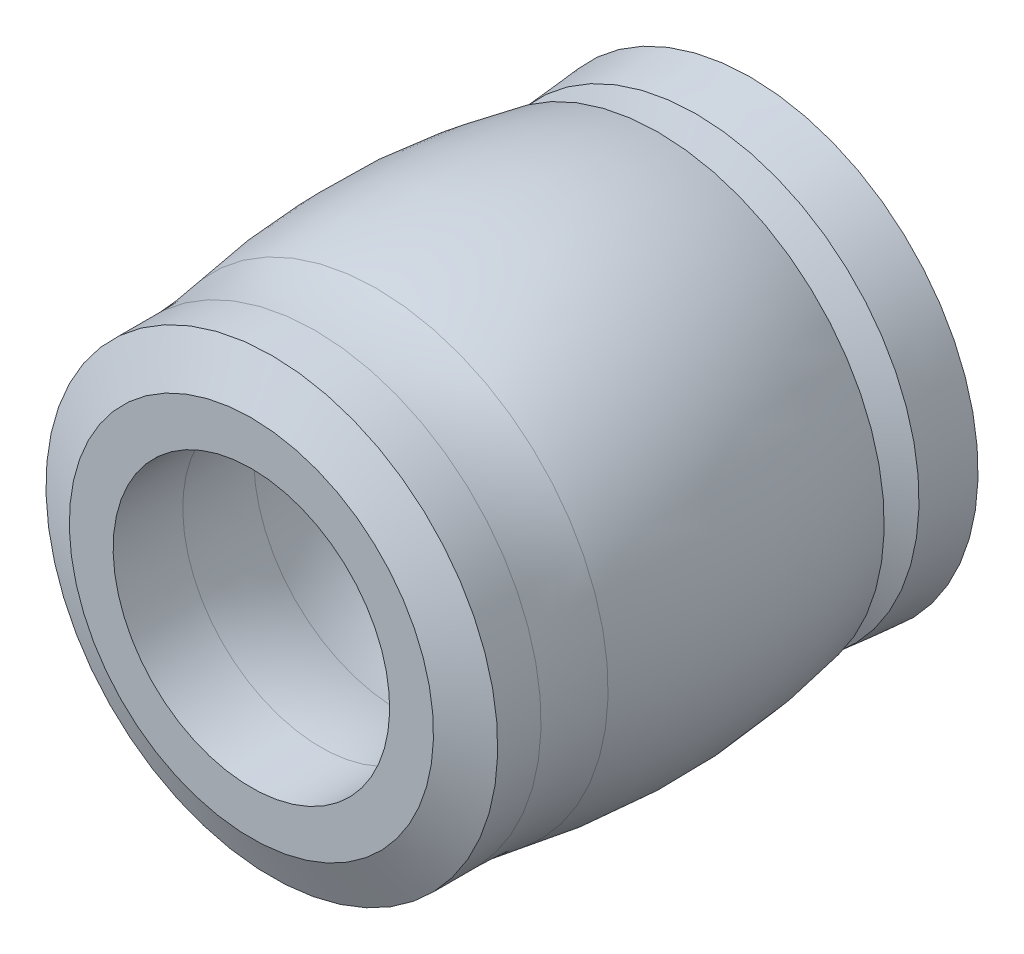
ISO-10303-21;
HEADER;
FILE_DESCRIPTION(('STEP AP214'),'2;1');
FILE_NAME('part.step','',(''),(''),'','','');
FILE_SCHEMA(('AUTOMOTIVE_DESIGN { 1 0 10303 214 1 1 1 1 }'));
ENDSEC;
DATA;
#1=APPLICATION_CONTEXT('core data for automotive mechanical design processes');
#2=APPLICATION_PROTOCOL_DEFINITION('international standard','automotive_design',2000,#1);
#3=PRODUCT_CONTEXT('',#1,'mechanical');
#4=PRODUCT('Part','Part','',(#3));
#5=PRODUCT_RELATED_PRODUCT_CATEGORY('part','',(#4));
#6=PRODUCT_DEFINITION_FORMATION('','',#4);
#7=PRODUCT_DEFINITION_CONTEXT('part definition',#1,'design');
#8=PRODUCT_DEFINITION('design','',#6,#7);
#9=PRODUCT_DEFINITION_SHAPE('','',#8);
#10=(LENGTH_UNIT() NAMED_UNIT(*) SI_UNIT(.MILLI.,.METRE.));
#11=(NAMED_UNIT(*) PLANE_ANGLE_UNIT() SI_UNIT($,.RADIAN.));
#12=(NAMED_UNIT(*) SI_UNIT($,.STERADIAN.) SOLID_ANGLE_UNIT());
#13=UNCERTAINTY_MEASURE_WITH_UNIT(LENGTH_MEASURE(1.E-05),#10,'distance_accuracy_value','');
#14=(GEOMETRIC_REPRESENTATION_CONTEXT(3) GLOBAL_UNCERTAINTY_ASSIGNED_CONTEXT((#13)) GLOBAL_UNIT_ASSIGNED_CONTEXT((#10,
#11,#12)) REPRESENTATION_CONTEXT('',''));
#15=CARTESIAN_POINT('',(0.,0.,0.));
#16=DIRECTION('',(0.,0.,1.));
#17=DIRECTION('',(1.,0.,0.));
#18=AXIS2_PLACEMENT_3D('',#15,#16,#17);
#19=CARTESIAN_POINT('',(0.,0.,7.81719223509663));
#20=DIRECTION('',(0.,0.,-1.));
#21=DIRECTION('',(0.,1.,0.));
#22=AXIS2_PLACEMENT_3D('',#19,#20,#21);
#23=TOROIDAL_SURFACE('',#22,12.954,2.54);
#24=CARTESIAN_POINT('',(0.,0.,7.81719223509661));
#25=DIRECTION('',(0.,0.,-1.));
#26=DIRECTION('',(0.,1.,0.));
#27=AXIS2_PLACEMENT_3D('',#24,#25,#26);
#28=CIRCLE('',#27,10.414);
#29=CARTESIAN_POINT('',(0.,10.414,7.81719223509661));
#30=VERTEX_POINT('',#29);
#31=EDGE_CURVE('E97',#30,#30,#28,.T.);
#32=ORIENTED_EDGE('',*,*,#31,.T.);
#33=EDGE_LOOP('',(#32));
#34=FACE_BOUND('',#33,.T.);
#35=CARTESIAN_POINT('',(0.,0.,8.42101933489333));
#36=DIRECTION('',(0.,0.,-1.));
#37=DIRECTION('',(0.,1.,0.));
#38=AXIS2_PLACEMENT_3D('',#35,#36,#37);
#39=CIRCLE('',#38,10.4868168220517);
#40=CARTESIAN_POINT('',(0.,10.4868168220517,8.42101933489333));
#41=VERTEX_POINT('',#40);
#42=EDGE_CURVE('E153',#41,#41,#39,.F.);
#43=ORIENTED_EDGE('',*,*,#42,.T.);
#44=EDGE_LOOP('',(#43));
#45=FACE_BOUND('',#44,.T.);
#46=ADVANCED_FACE('F12',(#34,#45),#23,.T.);
#47=CARTESIAN_POINT('',(0.,-30.8665991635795,18.542));
#48=DIRECTION('',(1.,0.,0.));
#49=DIRECTION('',(0.,1.,0.));
#50=AXIS2_PLACEMENT_3D('',#47,#48,#49);
#51=CIRCLE('',#50,42.57392703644);
#52=TRIMMED_CURVE('',#51,(PARAMETER_VALUE(-0.7597448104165)),(PARAMETER_VALUE(0.7597448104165)),
.T.,.PARAMETER.);
#53=CARTESIAN_POINT('',(0.,0.,18.542));
#54=DIRECTION('',(0.,0.,-1.));
#55=AXIS1_PLACEMENT('',#53,#54);
#56=SURFACE_OF_REVOLUTION('',#52,#55);
#57=ORIENTED_EDGE('',*,*,#42,.F.);
#58=EDGE_LOOP('',(#57));
#59=FACE_BOUND('',#58,.T.);
#60=CARTESIAN_POINT('',(0.,0.,26.449717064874));
#61=DIRECTION('',(0.,0.,-1.));
#62=DIRECTION('',(0.,1.,0.));
#63=AXIS2_PLACEMENT_3D('',#60,#61,#62);
#64=CIRCLE('',#63,10.9664891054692);
#65=CARTESIAN_POINT('',(0.,10.9664891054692,26.449717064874));
#66=VERTEX_POINT('',#65);
#67=EDGE_CURVE('E94',#66,#66,#64,.T.);
#68=ORIENTED_EDGE('',*,*,#67,.F.);
#69=EDGE_LOOP('',(#68));
#70=FACE_BOUND('',#69,.T.);
#71=ADVANCED_FACE('F101',(#59,#70),#56,.T.);
#72=CARTESIAN_POINT('',(0.,0.,-10.8003938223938));
#73=DIRECTION('',(0.,0.,-1.));
#74=DIRECTION('',(0.,1.,0.));
#75=AXIS2_PLACEMENT_3D('',#72,#73,#74);
#76=CYLINDRICAL_SURFACE('',#75,10.414);
#77=CARTESIAN_POINT('',(0.,0.,7.59227470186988));
#78=DIRECTION('',(0.,0.,1.));
#79=DIRECTION('',(0.,-1.,0.));
#80=AXIS2_PLACEMENT_3D('',#77,#78,#79);
#81=CIRCLE('',#80,10.414);
#82=CARTESIAN_POINT('',(0.,-10.414,7.59227470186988));
#83=VERTEX_POINT('',#82);
#84=EDGE_CURVE('E91',#83,#83,#81,.F.);
#85=ORIENTED_EDGE('',*,*,#84,.T.);
#86=EDGE_LOOP('',(#85));
#87=FACE_BOUND('',#86,.T.);
#88=ORIENTED_EDGE('',*,*,#31,.F.);
#89=EDGE_LOOP('',(#88));
#90=FACE_BOUND('',#89,.T.);
#91=ADVANCED_FACE('F84',(#87,#90),#76,.F.);
#92=CARTESIAN_POINT('',(0.,0.,32.3469888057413));
#93=DIRECTION('',(0.,0.,-1.));
#94=DIRECTION('',(0.,1.,0.));
#95=AXIS2_PLACEMENT_3D('',#92,#93,#94);
#96=TOROIDAL_SURFACE('',#95,42.164,31.75);
#97=ORIENTED_EDGE('',*,*,#67,.T.);
#98=EDGE_LOOP('',(#97));
#99=FACE_BOUND('',#98,.T.);
#100=CARTESIAN_POINT('',(0.,0.,32.3469888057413));
#101=DIRECTION('',(0.,0.,-1.));
#102=DIRECTION('',(0.,1.,0.));
#103=AXIS2_PLACEMENT_3D('',#100,#101,#102);
#104=CIRCLE('',#103,10.414);
#105=CARTESIAN_POINT('',(0.,10.414,32.3469888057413));
#106=VERTEX_POINT('',#105);
#107=EDGE_CURVE('E89',#106,#106,#104,.F.);
#108=ORIENTED_EDGE('',*,*,#107,.T.);
#109=EDGE_LOOP('',(#108));
#110=FACE_BOUND('',#109,.T.);
#111=ADVANCED_FACE('F79',(#99,#110),#96,.T.);
#112=CARTESIAN_POINT('',(0.,0.,7.59227470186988));
#113=DIRECTION('',(0.,0.,1.));
#114=DIRECTION('',(0.,-1.,0.));
#115=AXIS2_PLACEMENT_3D('',#112,#113,#114);
#116=CONICAL_SURFACE('',#115,10.414,1.13446401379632);
#117=ORIENTED_EDGE('',*,*,#84,.F.);
#118=EDGE_LOOP('',(#117));
#119=FACE_BOUND('',#118,.T.);
#120=CARTESIAN_POINT('',(0.,0.,4.572));
#121=DIRECTION('',(0.,0.,-1.));
#122=DIRECTION('',(0.,1.,0.));
#123=AXIS2_PLACEMENT_3D('',#120,#121,#122);
#124=CIRCLE('',#123,3.937);
#125=CARTESIAN_POINT('',(0.,3.937,4.572));
#126=VERTEX_POINT('',#125);
#127=EDGE_CURVE('E133',#126,#126,#124,.T.);
#128=ORIENTED_EDGE('',*,*,#127,.T.);
#129=EDGE_LOOP('',(#128));
#130=FACE_BOUND('',#129,.T.);
#131=ADVANCED_FACE('F75',(#119,#130),#116,.F.);
#132=CARTESIAN_POINT('',(0.,0.,-10.8003938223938));
#133=DIRECTION('',(0.,0.,-1.));
#134=DIRECTION('',(0.,1.,0.));
#135=AXIS2_PLACEMENT_3D('',#132,#133,#134);
#136=CYLINDRICAL_SURFACE('',#135,10.414);
#137=ORIENTED_EDGE('',*,*,#107,.F.);
#138=EDGE_LOOP('',(#137));
#139=FACE_BOUND('',#138,.T.);
#140=CARTESIAN_POINT('',(0.,0.,37.592));
#141=DIRECTION('',(0.,0.,-1.));
#142=DIRECTION('',(0.,1.,0.));
#143=AXIS2_PLACEMENT_3D('',#140,#141,#142);
#144=CIRCLE('',#143,10.414);
#145=CARTESIAN_POINT('',(0.,10.414,37.592));
#146=VERTEX_POINT('',#145);
#147=EDGE_CURVE('E16',#146,#146,#144,.T.);
#148=ORIENTED_EDGE('',*,*,#147,.F.);
#149=EDGE_LOOP('',(#148));
#150=FACE_BOUND('',#149,.T.);
#151=ADVANCED_FACE('F71',(#139,#150),#136,.F.);
#152=CARTESIAN_POINT('',(0.,0.,-10.8003938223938));
#153=DIRECTION('',(0.,0.,-1.));
#154=DIRECTION('',(0.,1.,0.));
#155=AXIS2_PLACEMENT_3D('',#152,#153,#154);
#156=CYLINDRICAL_SURFACE('',#155,3.937);
#157=CARTESIAN_POINT('',(0.,0.,0.));
#158=DIRECTION('',(0.,0.,-1.));
#159=DIRECTION('',(0.,1.,0.));
#160=AXIS2_PLACEMENT_3D('',#157,#158,#159);
#161=CIRCLE('',#160,3.937);
#162=CARTESIAN_POINT('',(0.,3.937,0.));
#163=VERTEX_POINT('',#162);
#164=EDGE_CURVE('E138',#163,#163,#161,.F.);
#165=ORIENTED_EDGE('',*,*,#164,.F.);
#166=EDGE_LOOP('',(#165));
#167=FACE_BOUND('',#166,.T.);
#168=ORIENTED_EDGE('',*,*,#127,.F.);
#169=EDGE_LOOP('',(#168));
#170=FACE_BOUND('',#169,.T.);
#171=ADVANCED_FACE('F67',(#167,#170),#156,.F.);
#172=CARTESIAN_POINT('',(13.716,0.,37.592));
#173=DIRECTION('',(0.,0.,1.));
#174=DIRECTION('',(0.,-1.,0.));
#175=AXIS2_PLACEMENT_3D('',#172,#173,#174);
#176=PLANE('',#175);
#177=CARTESIAN_POINT('',(0.,0.,37.592));
#178=DIRECTION('',(0.,0.,-1.));
#179=DIRECTION('',(0.,1.,0.));
#180=AXIS2_PLACEMENT_3D('',#177,#178,#179);
#181=CIRCLE('',#180,13.716);
#182=CARTESIAN_POINT('',(0.,13.716,37.592));
#183=VERTEX_POINT('',#182);
#184=EDGE_CURVE('E146',#183,#183,#181,.T.);
#185=ORIENTED_EDGE('',*,*,#184,.F.);
#186=EDGE_LOOP('',(#185));
#187=FACE_BOUND('',#186,.T.);
#188=ORIENTED_EDGE('',*,*,#147,.T.);
#189=EDGE_LOOP('',(#188));
#190=FACE_BOUND('',#189,.T.);
#191=ADVANCED_FACE('F63',(#187,#190),#176,.T.);
#192=CARTESIAN_POINT('',(3.937,0.,0.));
#193=DIRECTION('',(0.,0.,-1.));
#194=DIRECTION('',(0.,1.,0.));
#195=AXIS2_PLACEMENT_3D('',#192,#193,#194);
#196=PLANE('',#195);
#197=ORIENTED_EDGE('',*,*,#164,.T.);
#198=EDGE_LOOP('',(#197));
#199=FACE_BOUND('',#198,.T.);
#200=CARTESIAN_POINT('',(0.,0.,0.));
#201=DIRECTION('',(0.,0.,-1.));
#202=DIRECTION('',(0.,1.,0.));
#203=AXIS2_PLACEMENT_3D('',#200,#201,#202);
#204=CIRCLE('',#203,17.145);
#205=CARTESIAN_POINT('',(0.,17.145,0.));
#206=VERTEX_POINT('',#205);
#207=EDGE_CURVE('E132',#206,#206,#204,.F.);
#208=ORIENTED_EDGE('',*,*,#207,.F.);
#209=EDGE_LOOP('',(#208));
#210=FACE_BOUND('',#209,.T.);
#211=ADVANCED_FACE('F59',(#199,#210),#196,.T.);
#212=CARTESIAN_POINT('',(0.,0.,36.0522521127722));
#213=DIRECTION('',(0.,0.,-1.));
#214=DIRECTION('',(0.,1.,0.));
#215=AXIS2_PLACEMENT_3D('',#212,#213,#214);
#216=CONICAL_SURFACE('',#215,17.018,1.13446401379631);
#217=CARTESIAN_POINT('',(0.,0.,36.0522521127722));
#218=DIRECTION('',(0.,0.,-1.));
#219=DIRECTION('',(0.,1.,0.));
#220=AXIS2_PLACEMENT_3D('',#217,#218,#219);
#221=CIRCLE('',#220,17.018);
#222=CARTESIAN_POINT('',(0.,17.018,36.0522521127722));
#223=VERTEX_POINT('',#222);
#224=EDGE_CURVE('E128',#223,#223,#221,.T.);
#225=ORIENTED_EDGE('',*,*,#224,.F.);
#226=EDGE_LOOP('',(#225));
#227=FACE_BOUND('',#226,.T.);
#228=ORIENTED_EDGE('',*,*,#184,.T.);
#229=EDGE_LOOP('',(#228));
#230=FACE_BOUND('',#229,.T.);
#231=ADVANCED_FACE('F55',(#227,#230),#216,.T.);
#232=CARTESIAN_POINT('',(0.,0.,0.));
#233=DIRECTION('',(0.,0.,-1.));
#234=DIRECTION('',(0.,1.,0.));
#235=AXIS2_PLACEMENT_3D('',#232,#233,#234);
#236=CONICAL_SURFACE('',#235,17.145,0.0872664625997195);
#237=ORIENTED_EDGE('',*,*,#207,.T.);
#238=EDGE_LOOP('',(#237));
#239=FACE_BOUND('',#238,.T.);
#240=CARTESIAN_POINT('',(0.,0.,4.08802997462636));
#241=DIRECTION('',(0.,0.,-1.));
#242=DIRECTION('',(0.,1.,0.));
#243=AXIS2_PLACEMENT_3D('',#240,#241,#242);
#244=CIRCLE('',#243,16.787343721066);
#245=CARTESIAN_POINT('',(0.,16.787343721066,4.08802997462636));
#246=VERTEX_POINT('',#245);
#247=EDGE_CURVE('E126',#246,#246,#244,.F.);
#248=ORIENTED_EDGE('',*,*,#247,.F.);
#249=EDGE_LOOP('',(#248));
#250=FACE_BOUND('',#249,.T.);
#251=ADVANCED_FACE('F51',(#239,#250),#236,.T.);
#252=CARTESIAN_POINT('',(0.,0.,-10.8003938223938));
#253=DIRECTION('',(0.,0.,-1.));
#254=DIRECTION('',(0.,1.,0.));
#255=AXIS2_PLACEMENT_3D('',#252,#253,#254);
#256=CYLINDRICAL_SURFACE('',#255,17.018);
#257=CARTESIAN_POINT('',(0.,0.,32.7903074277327));
#258=DIRECTION('',(0.,0.,-1.));
#259=DIRECTION('',(0.,1.,0.));
#260=AXIS2_PLACEMENT_3D('',#257,#258,#259);
#261=CIRCLE('',#260,17.018);
#262=CARTESIAN_POINT('',(0.,17.018,32.7903074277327));
#263=VERTEX_POINT('',#262);
#264=EDGE_CURVE('E32',#263,#263,#261,.F.);
#265=ORIENTED_EDGE('',*,*,#264,.T.);
#266=EDGE_LOOP('',(#265));
#267=FACE_BOUND('',#266,.T.);
#268=ORIENTED_EDGE('',*,*,#224,.T.);
#269=EDGE_LOOP('',(#268));
#270=FACE_BOUND('',#269,.T.);
#271=ADVANCED_FACE('F47',(#267,#270),#256,.T.);
#272=CARTESIAN_POINT('',(0.,0.,4.08802997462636));
#273=DIRECTION('',(0.,0.,-1.));
#274=DIRECTION('',(1.,0.,0.));
#275=AXIS2_PLACEMENT_3D('',#272,#273,#274);
#276=CONICAL_SURFACE('',#275,16.787343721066,1.13446401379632);
#277=ORIENTED_EDGE('',*,*,#247,.T.);
#278=EDGE_LOOP('',(#277));
#279=FACE_BOUND('',#278,.T.);
#280=CARTESIAN_POINT('',(0.,0.,5.461));
#281=DIRECTION('',(0.,0.,1.));
#282=DIRECTION('',(0.,-1.,0.));
#283=AXIS2_PLACEMENT_3D('',#280,#281,#282);
#284=CIRCLE('',#283,13.843);
#285=CARTESIAN_POINT('',(0.,-13.843,5.461));
#286=VERTEX_POINT('',#285);
#287=EDGE_CURVE('E25',#286,#286,#284,.T.);
#288=ORIENTED_EDGE('',*,*,#287,.F.);
#289=EDGE_LOOP('',(#288));
#290=FACE_BOUND('',#289,.T.);
#291=ADVANCED_FACE('F42',(#279,#290),#276,.T.);
#292=CARTESIAN_POINT('',(0.,0.,32.7903074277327));
#293=DIRECTION('',(0.,0.,-1.));
#294=DIRECTION('',(0.,1.,0.));
#295=AXIS2_PLACEMENT_3D('',#292,#293,#294);
#296=TOROIDAL_SURFACE('',#295,42.418,25.4);
#297=CARTESIAN_POINT('',(0.,0.,28.1635839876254));
#298=DIRECTION('',(0.,0.,-1.));
#299=DIRECTION('',(0.,1.,0.));
#300=AXIS2_PLACEMENT_3D('',#297,#298,#299);
#301=CIRCLE('',#300,17.4429438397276);
#302=CARTESIAN_POINT('',(0.,17.4429438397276,28.1635839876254));
#303=VERTEX_POINT('',#302);
#304=EDGE_CURVE('E20',#303,#303,#301,.T.);
#305=ORIENTED_EDGE('',*,*,#304,.F.);
#306=EDGE_LOOP('',(#305));
#307=FACE_BOUND('',#306,.T.);
#308=ORIENTED_EDGE('',*,*,#264,.F.);
#309=EDGE_LOOP('',(#308));
#310=FACE_BOUND('',#309,.T.);
#311=ADVANCED_FACE('F37',(#307,#310),#296,.F.);
#312=CARTESIAN_POINT('',(0.,0.,6.94152681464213));
#313=DIRECTION('',(0.,0.,1.));
#314=DIRECTION('',(0.,-1.,0.));
#315=AXIS2_PLACEMENT_3D('',#312,#313,#314);
#316=CONICAL_SURFACE('',#315,17.018,1.13446401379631);
#317=CARTESIAN_POINT('',(0.,0.,6.94152681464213));
#318=DIRECTION('',(0.,0.,-1.));
#319=DIRECTION('',(0.,1.,0.));
#320=AXIS2_PLACEMENT_3D('',#317,#318,#319);
#321=CIRCLE('',#320,17.018);
#322=CARTESIAN_POINT('',(0.,17.018,6.94152681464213));
#323=VERTEX_POINT('',#322);
#324=EDGE_CURVE('E8',#323,#323,#321,.F.);
#325=ORIENTED_EDGE('',*,*,#324,.F.);
#326=EDGE_LOOP('',(#325));
#327=FACE_BOUND('',#326,.T.);
#328=ORIENTED_EDGE('',*,*,#287,.T.);
#329=EDGE_LOOP('',(#328));
#330=FACE_BOUND('',#329,.T.);
#331=ADVANCED_FACE('F41',(#327,#330),#316,.T.);
#332=CARTESIAN_POINT('',(0.,-34.268933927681,18.5837634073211));
#333=DIRECTION('',(1.,0.,0.));
#334=DIRECTION('',(0.,1.,0.));
#335=AXIS2_PLACEMENT_3D('',#332,#333,#334);
#336=CIRCLE('',#335,52.5917414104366);
#337=TRIMMED_CURVE('',#336,(PARAMETER_VALUE(-0.861100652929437)),
(PARAMETER_VALUE(0.861100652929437)),.T.,.PARAMETER.);
#338=CARTESIAN_POINT('',(0.,0.,18.5837634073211));
#339=DIRECTION('',(0.,0.,-1.));
#340=AXIS1_PLACEMENT('',#338,#339);
#341=SURFACE_OF_REVOLUTION('',#337,#340);
#342=ORIENTED_EDGE('',*,*,#324,.T.);
#343=EDGE_LOOP('',(#342));
#344=FACE_BOUND('',#343,.T.);
#345=ORIENTED_EDGE('',*,*,#304,.T.);
#346=EDGE_LOOP('',(#345));
#347=FACE_BOUND('',#346,.T.);
#348=ADVANCED_FACE('F114',(#344,#347),#341,.F.);
#349=CLOSED_SHELL('',(#46,#71,#91,#111,#131,#151,#171,#191,#211,#231,#251,#271,#291,#311,#331,#348));
#350=MANIFOLD_SOLID_BREP('B1',#349);
#351=ADVANCED_BREP_SHAPE_REPRESENTATION('',(#18,#350),#14);
#352=SHAPE_DEFINITION_REPRESENTATION(#9,#351);
ENDSEC;
END-ISO-10303-21;
